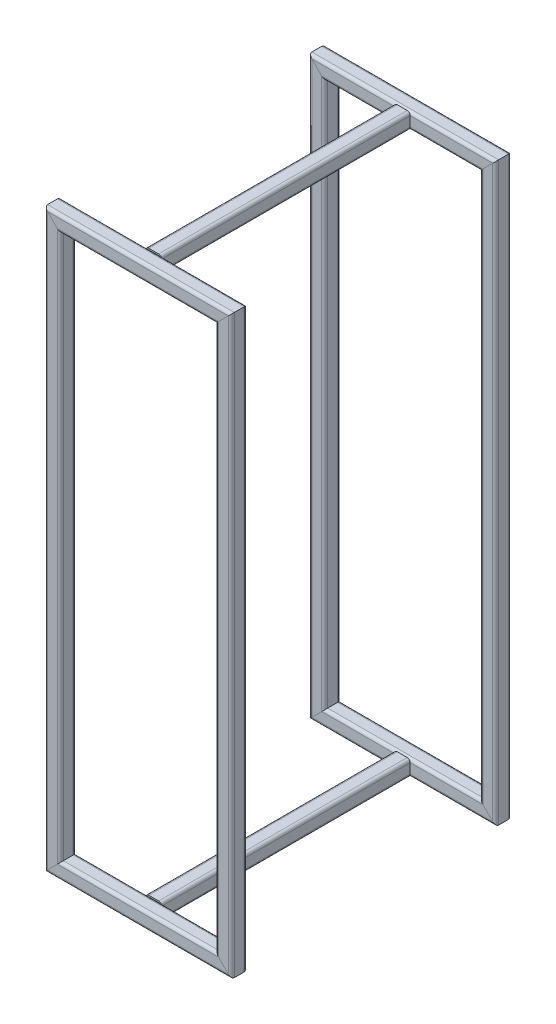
from build123d import *

# Parameters (mm, degrees)
TUBE_SQUARE_TS2X2X0_1875_1_DEPTH      = 1836.921024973
TUBE_SQUARE_TS2X2X0_1875_1_DEPTH_BACK = 36.921024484
TUBE_SQUARE_TS2X2X0_1875_1_2_DEPTH    = 623.042048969
TUBE_SQUARE_TS2X2X0_1875_1_3_DEPTH    = 1873.842049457
TUBE_SQUARE_TS2X2X0_1875_1_4_DEPTH    = 623.042048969
TUBE_SQUARE_TS2X2X0_1875_1_5_DEPTH    = 623.042048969
TUBE_SQUARE_TS2X2X0_1875_1_6_DEPTH    = 1873.842049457
TUBE_SQUARE_TS2X2X0_1875_1_7_DEPTH    = 623.042048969
TUBE_SQUARE_TS2X2X0_1875_1_8_DEPTH    = 1873.842049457
TUBE_SQUARE_TS2X2X0_1875_1_9_DEPTH    = 851.2
TUBE_SQUARE_TS2X2X0_1875_1_10_DEPTH   = 851.2


with BuildPart() as part:
    # Sketch1 → Tube square TS2X2X0.1875_1 (new, two sides: drawn at the far end of the back side and taken through both)
    with BuildSketch(Plane(origin=(274.6, -4.89e-07, 424.6), x_dir=(1, 0, 0), z_dir=(0, 1, 0)).offset(-TUBE_SQUARE_TS2X2X0_1875_1_DEPTH_BACK)):
        with BuildLine():
            Line((-15.875, -25.4), (15.875, -25.4))
            ThreePointArc((15.875, -25.4), (22.610192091, -22.610192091), (25.4, -15.875))
            Line((25.4, -15.875), (25.4, 15.875))
            ThreePointArc((25.4, 15.875), (22.610192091, 22.610192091), (15.875, 25.4))
            Line((15.875, 25.4), (-15.875, 25.4))
            ThreePointArc((-15.875, 25.4), (-22.610192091, 22.610192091), (-25.4, 15.875))
            Line((-25.4, 15.875), (-25.4, -15.875))
            ThreePointArc((-25.4, -15.875), (-22.610192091, -22.610192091), (-15.875, -25.4))
        make_face()
        with BuildLine():
            Line((-15.875, -20.6375), (15.875, -20.6375))
            ThreePointArc((15.875, -20.6375), (19.242596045, -19.242596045), (20.6375, -15.875))
            Line((20.6375, -15.875), (20.6375, 15.875))
            ThreePointArc((20.6375, 15.875), (19.242596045, 19.242596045), (15.875, 20.6375))
            Line((15.875, 20.6375), (-15.875, 20.6375))
            ThreePointArc((-15.875, 20.6375), (-19.242596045, 19.242596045), (-20.6375, 15.875))
            Line((-20.6375, 15.875), (-20.6375, -15.875))
            ThreePointArc((-20.6375, -15.875), (-19.242596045, -19.242596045), (-15.875, -20.6375))
        make_face(mode=Mode.SUBTRACT)
    extrude(amount=TUBE_SQUARE_TS2X2X0_1875_1_DEPTH + TUBE_SQUARE_TS2X2X0_1875_1_DEPTH_BACK)

    # Tube square TS2X2X0.1875_1 mitre 1
    split(bisect_by=Plane(origin=(274.6, -4.89e-07, 424.6), x_dir=(-0.707106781, 0.707106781, 0), z_dir=(0.707106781, 0.707106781, 0)), keep=Keep.TOP)

    # Tube square TS2X2X0.1875_1 mitre 2
    split(bisect_by=Plane(origin=(274.6, 1800, 424.6), x_dir=(0.707106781, 0.707106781, 0), z_dir=(0.707106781, -0.707106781, 0)), keep=Keep.TOP)


with BuildPart() as body_2:
    # Sketch1 on segment 2 (on carried to segment 2) → Tube square TS2X2X0.1875_1 2 (new body)
    with BuildSketch(Plane(origin=(311.521024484, 1800, 424.6), x_dir=(0, 1, 0), z_dir=(-1, 0, 0))):
        with BuildLine():
            Line((-15.875, -25.4), (15.875, -25.4))
            ThreePointArc((15.875, -25.4), (22.610192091, -22.610192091), (25.4, -15.875))
            Line((25.4, -15.875), (25.4, 15.875))
            ThreePointArc((25.4, 15.875), (22.610192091, 22.610192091), (15.875, 25.4))
            Line((15.875, 25.4), (-15.875, 25.4))
            ThreePointArc((-15.875, 25.4), (-22.610192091, 22.610192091), (-25.4, 15.875))
            Line((-25.4, 15.875), (-25.4, -15.875))
            ThreePointArc((-25.4, -15.875), (-22.610192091, -22.610192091), (-15.875, -25.4))
        make_face()
        with BuildLine():
            Line((-15.875, -20.6375), (15.875, -20.6375))
            ThreePointArc((15.875, -20.6375), (19.242596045, -19.242596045), (20.6375, -15.875))
            Line((20.6375, -15.875), (20.6375, 15.875))
            ThreePointArc((20.6375, 15.875), (19.242596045, 19.242596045), (15.875, 20.6375))
            Line((15.875, 20.6375), (-15.875, 20.6375))
            ThreePointArc((-15.875, 20.6375), (-19.242596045, 19.242596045), (-20.6375, 15.875))
            Line((-20.6375, 15.875), (-20.6375, -15.875))
            ThreePointArc((-20.6375, -15.875), (-19.242596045, -19.242596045), (-15.875, -20.6375))
        make_face(mode=Mode.SUBTRACT)
    extrude(amount=TUBE_SQUARE_TS2X2X0_1875_1_2_DEPTH)

    # Tube square TS2X2X0.1875_1 2 mitre 1
    split(bisect_by=Plane(origin=(274.6, 1800, 424.6), x_dir=(-0.707106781, -0.707106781, 0), z_dir=(-0.707106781, 0.707106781, 0)), keep=Keep.TOP)

    # Tube square TS2X2X0.1875_1 2 mitre 2
    split(bisect_by=Plane(origin=(-274.6, 1800, 424.6), x_dir=(-0.707106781, 0.707106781, 0), z_dir=(0.707106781, 0.707106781, 0)), keep=Keep.TOP)


with BuildPart() as body_3:
    # Sketch1 on segment 3 (on carried to segment 3) → Tube square TS2X2X0.1875_1 3 (new body)
    with BuildSketch(Plane(origin=(-274.6, 1836.921024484, 424.6), x_dir=(-1, 0, 0), z_dir=(0, -1, 0))):
        with BuildLine():
            Line((-15.875, -25.4), (15.875, -25.4))
            ThreePointArc((15.875, -25.4), (22.610192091, -22.610192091), (25.4, -15.875))
            Line((25.4, -15.875), (25.4, 15.875))
            ThreePointArc((25.4, 15.875), (22.610192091, 22.610192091), (15.875, 25.4))
            Line((15.875, 25.4), (-15.875, 25.4))
            ThreePointArc((-15.875, 25.4), (-22.610192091, 22.610192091), (-25.4, 15.875))
            Line((-25.4, 15.875), (-25.4, -15.875))
            ThreePointArc((-25.4, -15.875), (-22.610192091, -22.610192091), (-15.875, -25.4))
        make_face()
        with BuildLine():
            Line((-15.875, -20.6375), (15.875, -20.6375))
            ThreePointArc((15.875, -20.6375), (19.242596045, -19.242596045), (20.6375, -15.875))
            Line((20.6375, -15.875), (20.6375, 15.875))
            ThreePointArc((20.6375, 15.875), (19.242596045, 19.242596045), (15.875, 20.6375))
            Line((15.875, 20.6375), (-15.875, 20.6375))
            ThreePointArc((-15.875, 20.6375), (-19.242596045, 19.242596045), (-20.6375, 15.875))
            Line((-20.6375, 15.875), (-20.6375, -15.875))
            ThreePointArc((-20.6375, -15.875), (-19.242596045, -19.242596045), (-15.875, -20.6375))
        make_face(mode=Mode.SUBTRACT)
    extrude(amount=TUBE_SQUARE_TS2X2X0_1875_1_3_DEPTH)

    # Tube square TS2X2X0.1875_1 3 mitre 1
    split(bisect_by=Plane(origin=(-274.6, -4.89e-07, 424.6), x_dir=(-0.707106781, -0.707106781, 0), z_dir=(-0.707106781, 0.707106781, 0)), keep=Keep.TOP)

    # Tube square TS2X2X0.1875_1 3 mitre 2
    split(bisect_by=Plane(origin=(-274.6, 1800, 424.6), x_dir=(0.707106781, -0.707106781, 0), z_dir=(-0.707106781, -0.707106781, 0)), keep=Keep.TOP)


with BuildPart() as body_4:
    # Sketch1 on segment 4 (on carried to segment 4) → Tube square TS2X2X0.1875_1 4 (new body)
    with BuildSketch(Plane(origin=(-311.521024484, -4.89e-07, 424.6), x_dir=(0, -1, 0), z_dir=(1, 0, 0))):
        with BuildLine():
            Line((-15.875, -25.4), (15.875, -25.4))
            ThreePointArc((15.875, -25.4), (22.610192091, -22.610192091), (25.4, -15.875))
            Line((25.4, -15.875), (25.4, 15.875))
            ThreePointArc((25.4, 15.875), (22.610192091, 22.610192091), (15.875, 25.4))
            Line((15.875, 25.4), (-15.875, 25.4))
            ThreePointArc((-15.875, 25.4), (-22.610192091, 22.610192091), (-25.4, 15.875))
            Line((-25.4, 15.875), (-25.4, -15.875))
            ThreePointArc((-25.4, -15.875), (-22.610192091, -22.610192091), (-15.875, -25.4))
        make_face()
        with BuildLine():
            Line((-15.875, -20.6375), (15.875, -20.6375))
            ThreePointArc((15.875, -20.6375), (19.242596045, -19.242596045), (20.6375, -15.875))
            Line((20.6375, -15.875), (20.6375, 15.875))
            ThreePointArc((20.6375, 15.875), (19.242596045, 19.242596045), (15.875, 20.6375))
            Line((15.875, 20.6375), (-15.875, 20.6375))
            ThreePointArc((-15.875, 20.6375), (-19.242596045, 19.242596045), (-20.6375, 15.875))
            Line((-20.6375, 15.875), (-20.6375, -15.875))
            ThreePointArc((-20.6375, -15.875), (-19.242596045, -19.242596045), (-15.875, -20.6375))
        make_face(mode=Mode.SUBTRACT)
    extrude(amount=TUBE_SQUARE_TS2X2X0_1875_1_4_DEPTH)

    # Tube square TS2X2X0.1875_1 4 mitre 1
    split(bisect_by=Plane(origin=(274.6, -4.89e-07, 424.6), x_dir=(0.707106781, -0.707106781, 0), z_dir=(-0.707106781, -0.707106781, 0)), keep=Keep.TOP)

    # Tube square TS2X2X0.1875_1 4 mitre 2
    split(bisect_by=Plane(origin=(-274.6, -4.89e-07, 424.6), x_dir=(0.707106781, 0.707106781, 0), z_dir=(0.707106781, -0.707106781, 0)), keep=Keep.TOP)


with BuildPart() as body_5:
    # Sketch1 on segment 5 (on carried to segment 5) → Tube square TS2X2X0.1875_1 5 (new body)
    with BuildSketch(Plane(origin=(311.521024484, 1800, -424.6), x_dir=(0, 1, 0), z_dir=(-1, 0, 0))):
        with BuildLine():
            Line((-15.875, -25.4), (15.875, -25.4))
            ThreePointArc((15.875, -25.4), (22.610192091, -22.610192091), (25.4, -15.875))
            Line((25.4, -15.875), (25.4, 15.875))
            ThreePointArc((25.4, 15.875), (22.610192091, 22.610192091), (15.875, 25.4))
            Line((15.875, 25.4), (-15.875, 25.4))
            ThreePointArc((-15.875, 25.4), (-22.610192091, 22.610192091), (-25.4, 15.875))
            Line((-25.4, 15.875), (-25.4, -15.875))
            ThreePointArc((-25.4, -15.875), (-22.610192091, -22.610192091), (-15.875, -25.4))
        make_face()
        with BuildLine():
            Line((-15.875, -20.6375), (15.875, -20.6375))
            ThreePointArc((15.875, -20.6375), (19.242596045, -19.242596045), (20.6375, -15.875))
            Line((20.6375, -15.875), (20.6375, 15.875))
            ThreePointArc((20.6375, 15.875), (19.242596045, 19.242596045), (15.875, 20.6375))
            Line((15.875, 20.6375), (-15.875, 20.6375))
            ThreePointArc((-15.875, 20.6375), (-19.242596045, 19.242596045), (-20.6375, 15.875))
            Line((-20.6375, 15.875), (-20.6375, -15.875))
            ThreePointArc((-20.6375, -15.875), (-19.242596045, -19.242596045), (-15.875, -20.6375))
        make_face(mode=Mode.SUBTRACT)
    extrude(amount=TUBE_SQUARE_TS2X2X0_1875_1_5_DEPTH)

    # Tube square TS2X2X0.1875_1 5 mitre 1
    split(bisect_by=Plane(origin=(274.6, 1800, -424.6), x_dir=(-0.707106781, -0.707106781, 0), z_dir=(-0.707106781, 0.707106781, 0)), keep=Keep.TOP)

    # Tube square TS2X2X0.1875_1 5 mitre 2
    split(bisect_by=Plane(origin=(-274.6, 1800, -424.6), x_dir=(-0.707106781, 0.707106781, 0), z_dir=(0.707106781, 0.707106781, 0)), keep=Keep.TOP)


with BuildPart() as body_6:
    # Sketch1 on segment 6 (on carried to segment 6) → Tube square TS2X2X0.1875_1 6 (new body)
    with BuildSketch(Plane(origin=(-274.6, -36.921024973, -424.6), x_dir=(1, 0, 0), z_dir=(0, 1, 0))):
        with BuildLine():
            Line((-15.875, -25.4), (15.875, -25.4))
            ThreePointArc((15.875, -25.4), (22.610192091, -22.610192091), (25.4, -15.875))
            Line((25.4, -15.875), (25.4, 15.875))
            ThreePointArc((25.4, 15.875), (22.610192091, 22.610192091), (15.875, 25.4))
            Line((15.875, 25.4), (-15.875, 25.4))
            ThreePointArc((-15.875, 25.4), (-22.610192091, 22.610192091), (-25.4, 15.875))
            Line((-25.4, 15.875), (-25.4, -15.875))
            ThreePointArc((-25.4, -15.875), (-22.610192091, -22.610192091), (-15.875, -25.4))
        make_face()
        with BuildLine():
            Line((-15.875, -20.6375), (15.875, -20.6375))
            ThreePointArc((15.875, -20.6375), (19.242596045, -19.242596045), (20.6375, -15.875))
            Line((20.6375, -15.875), (20.6375, 15.875))
            ThreePointArc((20.6375, 15.875), (19.242596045, 19.242596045), (15.875, 20.6375))
            Line((15.875, 20.6375), (-15.875, 20.6375))
            ThreePointArc((-15.875, 20.6375), (-19.242596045, 19.242596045), (-20.6375, 15.875))
            Line((-20.6375, 15.875), (-20.6375, -15.875))
            ThreePointArc((-20.6375, -15.875), (-19.242596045, -19.242596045), (-15.875, -20.6375))
        make_face(mode=Mode.SUBTRACT)
    extrude(amount=TUBE_SQUARE_TS2X2X0_1875_1_6_DEPTH)

    # Tube square TS2X2X0.1875_1 6 mitre 1
    split(bisect_by=Plane(origin=(-274.6, -4.89e-07, -424.6), x_dir=(-0.707106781, -0.707106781, 0), z_dir=(-0.707106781, 0.707106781, 0)), keep=Keep.TOP)

    # Tube square TS2X2X0.1875_1 6 mitre 2
    split(bisect_by=Plane(origin=(-274.6, 1800, -424.6), x_dir=(0.707106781, -0.707106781, 0), z_dir=(-0.707106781, -0.707106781, 0)), keep=Keep.TOP)


with BuildPart() as body_7:
    # Sketch1 on segment 7 (on carried to segment 7) → Tube square TS2X2X0.1875_1 7 (new body)
    with BuildSketch(Plane(origin=(311.521024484, -4.89e-07, -424.6), x_dir=(0, 1, 0), z_dir=(-1, 0, 0))):
        with BuildLine():
            Line((-15.875, -25.4), (15.875, -25.4))
            ThreePointArc((15.875, -25.4), (22.610192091, -22.610192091), (25.4, -15.875))
            Line((25.4, -15.875), (25.4, 15.875))
            ThreePointArc((25.4, 15.875), (22.610192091, 22.610192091), (15.875, 25.4))
            Line((15.875, 25.4), (-15.875, 25.4))
            ThreePointArc((-15.875, 25.4), (-22.610192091, 22.610192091), (-25.4, 15.875))
            Line((-25.4, 15.875), (-25.4, -15.875))
            ThreePointArc((-25.4, -15.875), (-22.610192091, -22.610192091), (-15.875, -25.4))
        make_face()
        with BuildLine():
            Line((-15.875, -20.6375), (15.875, -20.6375))
            ThreePointArc((15.875, -20.6375), (19.242596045, -19.242596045), (20.6375, -15.875))
            Line((20.6375, -15.875), (20.6375, 15.875))
            ThreePointArc((20.6375, 15.875), (19.242596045, 19.242596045), (15.875, 20.6375))
            Line((15.875, 20.6375), (-15.875, 20.6375))
            ThreePointArc((-15.875, 20.6375), (-19.242596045, 19.242596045), (-20.6375, 15.875))
            Line((-20.6375, 15.875), (-20.6375, -15.875))
            ThreePointArc((-20.6375, -15.875), (-19.242596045, -19.242596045), (-15.875, -20.6375))
        make_face(mode=Mode.SUBTRACT)
    extrude(amount=TUBE_SQUARE_TS2X2X0_1875_1_7_DEPTH)

    # Tube square TS2X2X0.1875_1 7 mitre 1
    split(bisect_by=Plane(origin=(274.6, -4.89e-07, -424.6), x_dir=(0.707106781, -0.707106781, 0), z_dir=(-0.707106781, -0.707106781, 0)), keep=Keep.TOP)

    # Tube square TS2X2X0.1875_1 7 mitre 2
    split(bisect_by=Plane(origin=(-274.6, -4.89e-07, -424.6), x_dir=(0.707106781, 0.707106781, 0), z_dir=(0.707106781, -0.707106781, 0)), keep=Keep.TOP)


with BuildPart() as body_8:
    # Sketch1 on segment 8 (on carried to segment 8) → Tube square TS2X2X0.1875_1 8 (new body)
    with BuildSketch(Plane(origin=(274.6, -36.921024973, -424.6), x_dir=(1, 0, 0), z_dir=(0, 1, 0))):
        with BuildLine():
            Line((-15.875, -25.4), (15.875, -25.4))
            ThreePointArc((15.875, -25.4), (22.610192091, -22.610192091), (25.4, -15.875))
            Line((25.4, -15.875), (25.4, 15.875))
            ThreePointArc((25.4, 15.875), (22.610192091, 22.610192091), (15.875, 25.4))
            Line((15.875, 25.4), (-15.875, 25.4))
            ThreePointArc((-15.875, 25.4), (-22.610192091, 22.610192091), (-25.4, 15.875))
            Line((-25.4, 15.875), (-25.4, -15.875))
            ThreePointArc((-25.4, -15.875), (-22.610192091, -22.610192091), (-15.875, -25.4))
        make_face()
        with BuildLine():
            Line((-15.875, -20.6375), (15.875, -20.6375))
            ThreePointArc((15.875, -20.6375), (19.242596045, -19.242596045), (20.6375, -15.875))
            Line((20.6375, -15.875), (20.6375, 15.875))
            ThreePointArc((20.6375, 15.875), (19.242596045, 19.242596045), (15.875, 20.6375))
            Line((15.875, 20.6375), (-15.875, 20.6375))
            ThreePointArc((-15.875, 20.6375), (-19.242596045, 19.242596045), (-20.6375, 15.875))
            Line((-20.6375, 15.875), (-20.6375, -15.875))
            ThreePointArc((-20.6375, -15.875), (-19.242596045, -19.242596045), (-15.875, -20.6375))
        make_face(mode=Mode.SUBTRACT)
    extrude(amount=TUBE_SQUARE_TS2X2X0_1875_1_8_DEPTH)

    # Tube square TS2X2X0.1875_1 8 mitre 1
    split(bisect_by=Plane(origin=(274.6, -4.89e-07, -424.6), x_dir=(-0.707106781, 0.707106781, 0), z_dir=(0.707106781, 0.707106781, 0)), keep=Keep.TOP)

    # Tube square TS2X2X0.1875_1 8 mitre 2
    split(bisect_by=Plane(origin=(274.6, 1800, -424.6), x_dir=(0.707106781, 0.707106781, 0), z_dir=(0.707106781, -0.707106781, 0)), keep=Keep.TOP)


with BuildPart() as body_9:
    # Sketch1 on segment 9 (on carried to segment 9) → Tube square TS2X2X0.1875_1 9 (new body)
    with BuildSketch(Plane(origin=(0, 1800, -425.6), x_dir=(1, 0, 0), z_dir=(0, 0, 1))):
        with BuildLine():
            Line((-15.875, -25.4), (15.875, -25.4))
            ThreePointArc((15.875, -25.4), (22.610192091, -22.610192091), (25.4, -15.875))
            Line((25.4, -15.875), (25.4, 15.875))
            ThreePointArc((25.4, 15.875), (22.610192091, 22.610192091), (15.875, 25.4))
            Line((15.875, 25.4), (-15.875, 25.4))
            ThreePointArc((-15.875, 25.4), (-22.610192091, 22.610192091), (-25.4, 15.875))
            Line((-25.4, 15.875), (-25.4, -15.875))
            ThreePointArc((-25.4, -15.875), (-22.610192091, -22.610192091), (-15.875, -25.4))
        make_face()
        with BuildLine():
            Line((-15.875, -20.6375), (15.875, -20.6375))
            ThreePointArc((15.875, -20.6375), (19.242596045, -19.242596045), (20.6375, -15.875))
            Line((20.6375, -15.875), (20.6375, 15.875))
            ThreePointArc((20.6375, 15.875), (19.242596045, 19.242596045), (15.875, 20.6375))
            Line((15.875, 20.6375), (-15.875, 20.6375))
            ThreePointArc((-15.875, 20.6375), (-19.242596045, 19.242596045), (-20.6375, 15.875))
            Line((-20.6375, 15.875), (-20.6375, -15.875))
            ThreePointArc((-20.6375, -15.875), (-19.242596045, -19.242596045), (-15.875, -20.6375))
        make_face(mode=Mode.SUBTRACT)
    extrude(amount=TUBE_SQUARE_TS2X2X0_1875_1_9_DEPTH)

    # Tube square TS2X2X0.1875_1 9 mitre 1
    split(bisect_by=Plane(origin=(0, 1800, -399.2), x_dir=(0, -1, 0), z_dir=(0, 0, 1)), keep=Keep.TOP)

    # Tube square TS2X2X0.1875_1 9 mitre 2
    split(bisect_by=Plane(origin=(0, 1800, 399.2), x_dir=(0, 1, 0), z_dir=(0, 0, -1)), keep=Keep.TOP)


with BuildPart() as body_10:
    # Sketch1 on segment 10 (on carried to segment 10) → Tube square TS2X2X0.1875_1 10 (new body)
    with BuildSketch(Plane(origin=(0, -4.89e-07, -425.6), x_dir=(1, 0, 0), z_dir=(0, 0, 1))):
        with BuildLine():
            Line((-15.875, -25.4), (15.875, -25.4))
            ThreePointArc((15.875, -25.4), (22.610192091, -22.610192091), (25.4, -15.875))
            Line((25.4, -15.875), (25.4, 15.875))
            ThreePointArc((25.4, 15.875), (22.610192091, 22.610192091), (15.875, 25.4))
            Line((15.875, 25.4), (-15.875, 25.4))
            ThreePointArc((-15.875, 25.4), (-22.610192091, 22.610192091), (-25.4, 15.875))
            Line((-25.4, 15.875), (-25.4, -15.875))
            ThreePointArc((-25.4, -15.875), (-22.610192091, -22.610192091), (-15.875, -25.4))
        make_face()
        with BuildLine():
            Line((-15.875, -20.6375), (15.875, -20.6375))
            ThreePointArc((15.875, -20.6375), (19.242596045, -19.242596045), (20.6375, -15.875))
            Line((20.6375, -15.875), (20.6375, 15.875))
            ThreePointArc((20.6375, 15.875), (19.242596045, 19.242596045), (15.875, 20.6375))
            Line((15.875, 20.6375), (-15.875, 20.6375))
            ThreePointArc((-15.875, 20.6375), (-19.242596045, 19.242596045), (-20.6375, 15.875))
            Line((-20.6375, 15.875), (-20.6375, -15.875))
            ThreePointArc((-20.6375, -15.875), (-19.242596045, -19.242596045), (-15.875, -20.6375))
        make_face(mode=Mode.SUBTRACT)
    extrude(amount=TUBE_SQUARE_TS2X2X0_1875_1_10_DEPTH)

    # Tube square TS2X2X0.1875_1 10 mitre 1
    split(bisect_by=Plane(origin=(0, -4.89e-07, -399.2), x_dir=(0, -1, 0), z_dir=(0, 0, 1)), keep=Keep.TOP)

    # Tube square TS2X2X0.1875_1 10 mitre 2
    split(bisect_by=Plane(origin=(0, -4.89e-07, 399.2), x_dir=(0, 1, 0), z_dir=(0, 0, -1)), keep=Keep.TOP)


solid = Compound([part.part, body_2.part, body_3.part, body_4.part, body_5.part, body_6.part, body_7.part, body_8.part, body_9.part, body_10.part])
